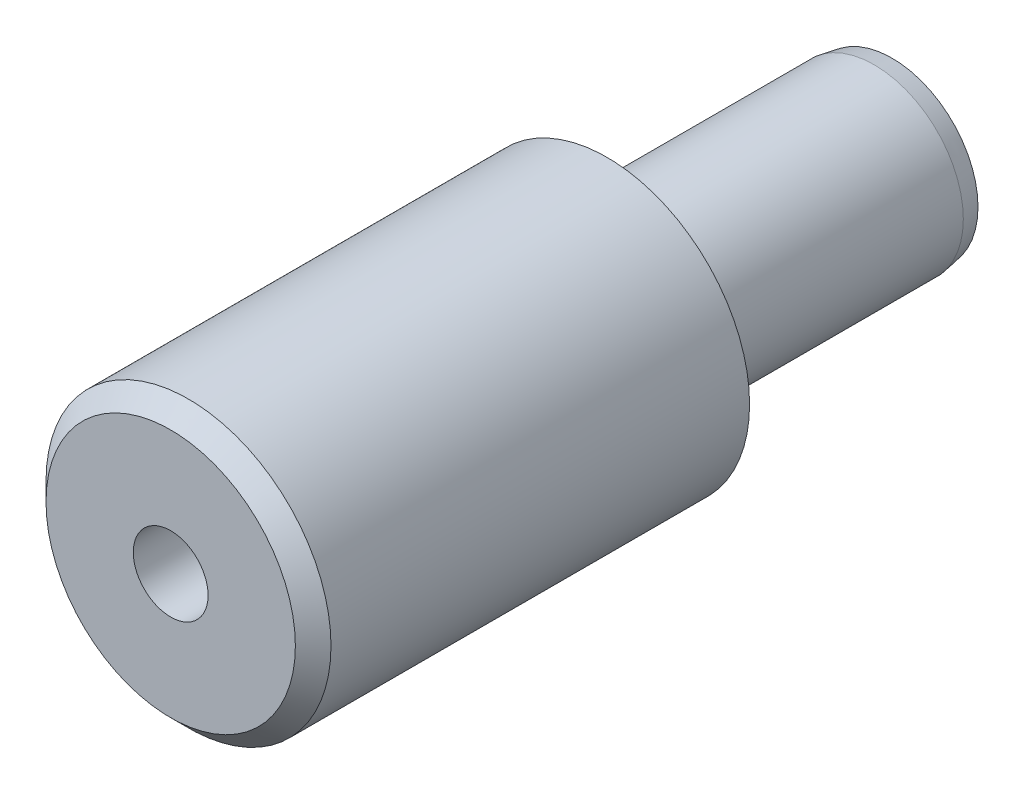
from build123d import *

# Parameters (mm, degrees)
SHOULDERFV_W                        = 8
SHOULDERFV_H                        = 24.5
M5X0_8_BOTTOMING_TAPPED_HOLE1_D     = 4.2
M5X0_8_BOTTOMING_TAPPED_HOLE1_DEPTH = 13
M5X0_8_BOTTOMING_TAPPED_HOLE1_TIP   = 1.2618073
FILLET1_R                           = 0.8
CHAMFER1_SIZE                       = 1


with BuildPart() as part:
    # ShoulderFV → Revolve1 (revolve)
    with BuildSketch(Plane(origin=(0, 0, 0), x_dir=(1, 0, 0), z_dir=(0, 1, 0))):
        with Locations((4, -12.75)):
            Rectangle(SHOULDERFV_W, SHOULDERFV_H)
    revolve(axis=Axis((0, 0, 0.5), (0, 0, -1)))

    # PinFV → Revolve2 (revolve)
    with BuildSketch(Plane(origin=(0, 0, 0), x_dir=(1, 0, 0), z_dir=(0, 1, 0))):
        Polygon((0, -0.5), (0, 15.5), (4.823673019, 15.5), (5, 14.5), (5, -0.5), align=None)
    revolve(axis=Axis((0, 0, -15.5), (0, 0, -1)))

    # M5x0.8 Bottoming Tapped Hole1
    with Locations(Plane.XY.offset(25)):
        with Locations((0, 0)):
            Hole(M5X0_8_BOTTOMING_TAPPED_HOLE1_D / 2, depth=M5X0_8_BOTTOMING_TAPPED_HOLE1_DEPTH)
            with Locations((0, 0, -(M5X0_8_BOTTOMING_TAPPED_HOLE1_DEPTH + M5X0_8_BOTTOMING_TAPPED_HOLE1_TIP / 2))):  # 118° drill point
                Cone(0, M5X0_8_BOTTOMING_TAPPED_HOLE1_D / 2, M5X0_8_BOTTOMING_TAPPED_HOLE1_TIP, mode=Mode.SUBTRACT)

    # Fillet1
    fillet1_edges = [part.edges().sort_by_distance(p)[0] for p in [
        (-5, 0, 0.5),
    ]]
    fillet(fillet1_edges, radius=FILLET1_R)

    # Chamfer1
    chamfer1_edges = [part.edges().sort_by_distance(p)[0] for p in [
        (-8, 0, 25),
    ]]
    chamfer(chamfer1_edges, length=CHAMFER1_SIZE)


solid = part.part
